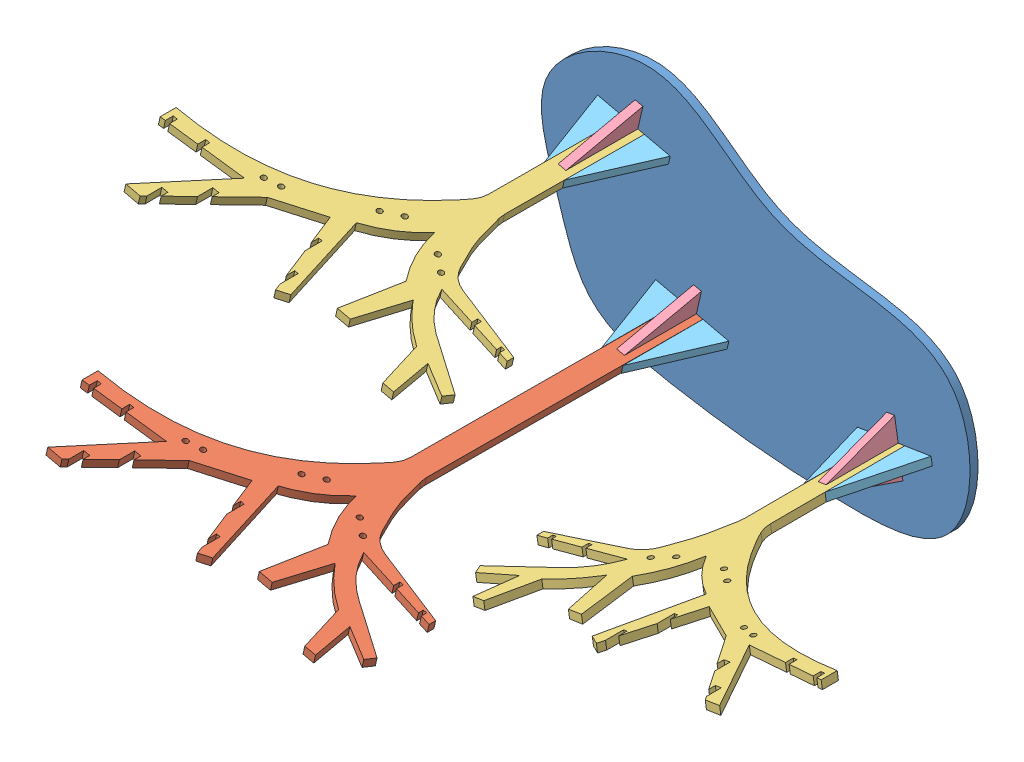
SolidWorks assembly assemblage.SLDASM, configuration Défaut (file format 11000). Lengths in mm.
Overall size (249.25 105.99 182.64).
13 component instances, 5 part files, 31 mates.
Components (placement in the parent):
- base-1: base.SLDPRT [Défaut] at origin size (161.54 105.99 3)
- arbre1-1: arbre1.SLDPRT [Défaut] at (-9.9367 -10.633 -61.05) x (0.9748 -0.223082 0) z (-0.223082 -0.9748 0) size (121.66 182.64 3)
- arbre2-1: arbre2.SLDPRT [Défaut] at (-31.7387 38.468 -112.1633) x (0.9748 -0.223082 0) z (-0.223082 -0.9748 0) size (121.66 131.53 3)
- arbre2-2: arbre2.SLDPRT [Défaut] at (78.8761 -18.8036 -112.1633) x (-0.987688 -0.156434 0) z (-0.156434 0.987688 0) size (121.66 131.53 3)
- equerre-1: equerre.SLDPRT [Défaut] at (70.887 -18.5502 3) x (-0.156434 0.987688 0) z (0.987688 0.156434 0) size (20 27 3)
- equerre-2: equerre.SLDPRT [Défaut] at (-5.3811 -13.2143 3) x (0.223082 0.9748 0) z (0.9748 -0.223082 0) size (20 27 3)
- equerre-3: equerre.SLDPRT [Défaut] at (-27.3445 35.9237 3) x (0.223082 0.9748 0) z (0.9748 -0.223082 0) size (20 27 3)
- renfort-1: renfort.SLDPRT [Défaut] at (86.4404 -17.6055 2.9715) x (-0.987683 -0.156434 0.003239) z (-0.156434 0.987688 0) size (10 30 3)
- renfort-2: renfort.SLDPRT [Défaut] at (9.3936 -18.1343 3) x (-0.9748 0.223082 0) z (0.223082 0.9748 0) size (10 30 3)
- renfort-3: renfort.SLDPRT [Défaut] at (-12.5811 31.0063 2.9571) x (-0.974792 0.223081 -0.003964) z (0.223082 0.9748 0) size (10 30 3)
- renfort-4: renfort.SLDPRT [Défaut] at (58.3063 -19.0241 3) x (0.987688 0.156434 0) z (0.156434 -0.987688 0) size (10 30 3)
- renfort-6: renfort.SLDPRT [Défaut] at (-17.3894 -8.9274 3) x (0.9748 -0.223082 0) z (-0.223082 -0.9748 0) size (10 30 3)
- renfort-7: renfort.SLDPRT [Défaut] at (-39.1949 40.1744 3) x (0.9748 -0.223082 0) z (-0.223082 -0.9748 0) size (10 30 3)
Mates (geometry in assembly coordinates):
- Distance1: distance = 40 mm: plane of arbre1-1 through (9.6879 -15.124 106.4116) normal (0.223082 0.9748 0); plane of arbre2-1 through (-12.7833 31.0526 55.2982) normal (-0.223082 -0.9748 0)
- Coïncidente24: coincident: plane of arbre2-2 through (72.2167 -26.9456 0) normal (0.987688 0.156434 0); plane of equerre-1 through (70.887 -18.5502 3) normal (-0.987688 -0.156434 0)
- Coïncidente25: coincident: plane of arbre2-2 through (72.2167 -26.9456 30) normal (0 0 -1); plane of equerre-1 through (73.6154 -16.5994 30) normal (0 0 1)
- Coïncidente28: coincident: line of arbre2-2 through (70.6524 -17.0687 30) axis (0.987688 0.156434 0); line of equerre-1 through (73.6154 -16.5994 30) axis (-0.987688 -0.156434 0)
- Coïncidente33: coincident: plane of arbre1-1 through (-0.5605 -5.5977 0) normal (-0.9748 0.223082 0); plane of equerre-2 through (-2.4567 -13.8835 3) normal (0.9748 -0.223082 0)
- Coïncidente34: coincident: plane of arbre1-1 through (-3.4849 -4.9285 30) normal (0 0 -1); plane of equerre-2 through (-2.1221 -12.4213 30) normal (0 0 1)
- Coïncidente35: coincident: line of arbre1-1 through (-5.0465 -11.7521 30) axis (0.9748 -0.223082 0); line of equerre-2 through (-2.1221 -12.4213 30) axis (-0.9748 0.223082 0)
- Coïncidente36: coincident: plane of base-1 through (54.4673 -46.3127 0) normal (0 0 -1); plane of arbre2-1 through (-30.1161 35.0192 0) normal (0 0 -1)
- Coïncidente38: coincident: plane of base-1 through (54.4673 -46.3127 0) normal (0 0 -1); plane of arbre1-1 through (-8.1528 -14.1188 0) normal (0 0 -1)
- Coïncidente40: coincident: plane of base-1 through (54.4673 -46.3127 0) normal (0 0 -1); plane of arbre2-2 through (76.0847 -16.2083 0) normal (0 0 -1)
- Coïncidente41: coincident: plane of base-1 through (-30.1161 35.0192 -7) normal (0.223082 0.9748 0); plane of arbre2-1 through (-12.7833 31.0526 55.2982) normal (-0.223082 -0.9748 0)
- Angle1: planar angle = 2.759538 rad: plane of arbre2-2 through (58.5227 -18.9899 55.2982) normal (-0.156434 0.987688 0); plane of arbre1-1 through (9.6879 -15.124 106.4116) normal (0.223082 0.9748 0)
- Coïncidente47: coincident: plane of arbre2-2 through (76.0847 -16.2083 0) normal (0.987683 0.156434 -0.003239); plane of renfort-1 through (76.0943 -16.2068 3.0039) normal (-0.987683 -0.156434 0.003239)
- Coïncidente49: coincident: plane of arbre2-2 through (58.992 -21.9529 55.2982) normal (0.156434 -0.987688 0); plane of renfort-1 through (86.4404 -17.6055 2.9715) normal (0.156434 -0.987688 0)
- Coïncidente50: coincident: plane of base-1 through (54.4673 -46.3127 3) normal (0 0 1); plane of renfort-2 through (10.0629 -15.2099 3) normal (0 0 -1)
- Coïncidente51: coincident: plane of arbre1-1 through (9.0186 -18.0484 106.4116) normal (-0.223082 -0.9748 0); plane of renfort-2 through (9.3936 -18.1343 3) normal (-0.223082 -0.9748 0)
- Coïncidente53: coincident: line of base-1 through (-0.3544 -15.9034 3) axis (0.223082 0.9748 0); line of renfort-2 through (0.3149 -12.979 3) axis (-0.223082 -0.9748 0)
- Coïncidente54: coincident: plane of base-1 through (54.4673 -46.3127 3) normal (0 0 1); plane of equerre-3 through (-22.1893 45.0024 3) normal (0 0 -1)
- Coïncidente55: coincident: plane of arbre2-1 through (-22.5239 43.5402 0) normal (-0.9748 0.223082 0); plane of equerre-3 through (-24.4201 35.2544 3) normal (0.9748 -0.223082 0)
- Coïncidente56: coincident: line of arbre2-1 through (-27.0099 37.3859 30) axis (0.9748 -0.223082 0); plane of equerre-3 through (-24.0855 36.7166 30) normal (0 0 1)
- Coïncidente57: coincident: line of arbre2-1 through (-27.0099 37.3859 30) axis (0.9748 -0.223082 0); line of equerre-3 through (-24.0855 36.7166 30) axis (-0.9748 0.223082 0)
- Coïncidente58: coincident: plane of arbre2-1 through (-22.3177 33.2345 0) normal (0.974792 -0.223081 0.003964); plane of renfort-3 through (-21.6597 36.1615 2.9174) normal (-0.974792 0.223081 -0.003964)
- Coïncidente59: coincident: plane of arbre2-1 through (-12.1141 33.977 55.2982) normal (0.223082 0.9748 0); plane of renfort-3 through (-11.9118 33.9307 2.9571) normal (0.223082 0.9748 0)
- Coïncidente62: coincident: plane of base-1 through (54.4673 -46.3127 3) normal (0 0 1); plane of renfort-4 through (58.7756 -21.9872 3) normal (0 0 -1)
- Coïncidente64: coincident: line of base-1 through (76.0847 -16.2083 3) axis (-0.987688 -0.156434 0); line of renfort-4 through (58.3063 -19.0241 3) axis (0.987688 0.156434 0)
- Coïncidente66: coincident: point of base-1; point of renfort-4
- Coïncidente67: coincident: plane of base-1 through (54.4673 -46.3127 3) normal (0 0 1); plane of renfort-7 through (-39.8641 37.25 3) normal (0 0 -1)
- Coïncidente68: coincident: point of base-1; point of renfort-7
- Parallèle9: parallel: plane of arbre2-1 through (-12.1141 33.977 55.2982) normal (0.223082 0.9748 0); plane of renfort-7 through (-39.1949 40.1744 3) normal (0.223082 0.9748 0)
- Coïncidente70: coincident: plane of base-1 through (54.4673 -46.3127 3) normal (0 0 1); plane of renfort-6 through (-18.0587 -11.8518 3) normal (0 0 -1)
- Coïncidente71: coincident: plane of arbre1-1 through (9.0186 -18.0484 106.4116) normal (-0.223082 -0.9748 0); plane of renfort-6 through (-18.0587 -11.8518 3) normal (-0.223082 -0.9748 0)
